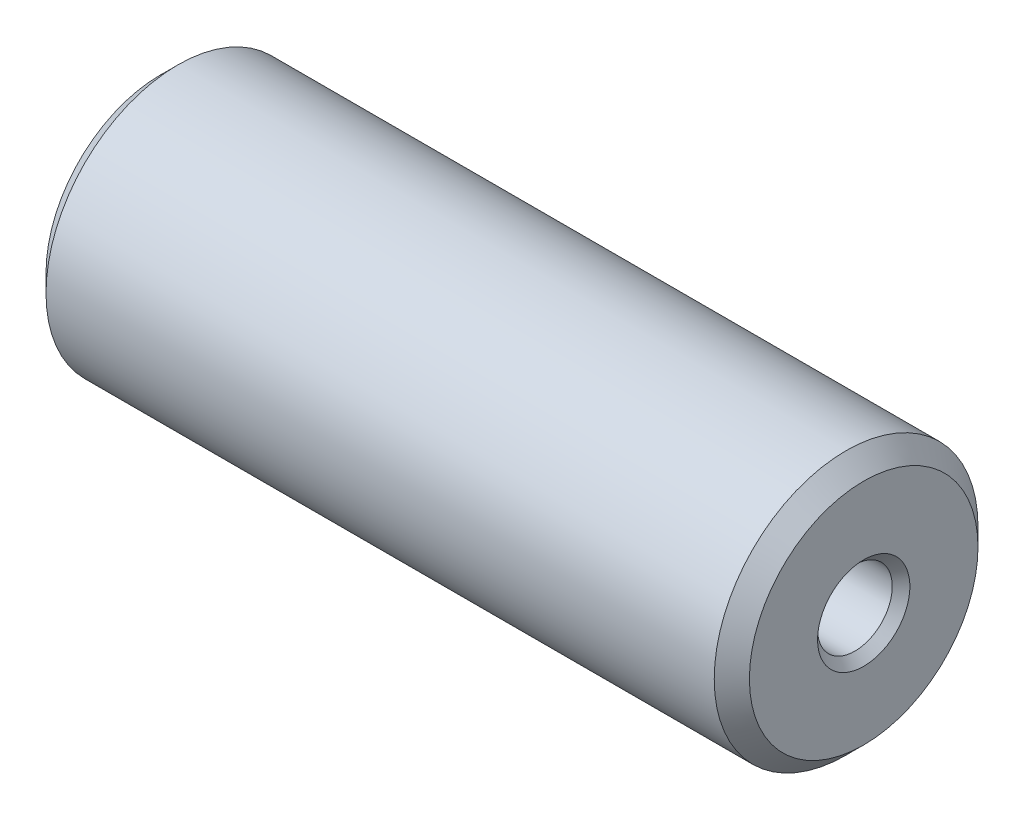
from build123d import *

# Parameters (mm, degrees)
SKETCH_1_W          = 80
SKETCH_1_H          = 15
SKETCH_2_R          = 4.25
CUT_EXTRUDE_1_DEPTH = 83.764726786
CHAMFER_1_SIZE      = 1
CHAMFER_2_SIZE      = 2


with BuildPart() as part:
    # Sketch 1 → Revolve 1 (revolve)
    with BuildSketch(Plane.XY, mode=Mode.PRIVATE) as revolve_1_sk:
        with Locations((40, 7.5)):
            Rectangle(SKETCH_1_W, SKETCH_1_H)
    revolve(revolve_1_sk.sketch.rotate(Axis((0, 0, 0), (1, 0, 0)), 90), axis=Axis((0, 0, 0), (1, 0, 0)))

    # Sketch 2 → Cut-Extrude 1 (cut, through all)
    with BuildSketch(Plane.ZY):
        Circle(SKETCH_2_R)
    extrude(amount=-CUT_EXTRUDE_1_DEPTH, mode=Mode.SUBTRACT)

    # Chamfer 1
    chamfer_1_edges = [part.edges().sort_by_distance(p)[0] for p in [
        (80, 0, -4.25),
        (0, 0, -4.25),
    ]]
    chamfer(chamfer_1_edges, length=CHAMFER_1_SIZE)

    # Chamfer 2
    chamfer_2_edges = [part.edges().sort_by_distance(p)[0] for p in [
        (80, 0, -15),
        (0, 0, -15),
    ]]
    chamfer(chamfer_2_edges, length=CHAMFER_2_SIZE)


solid = part.part
